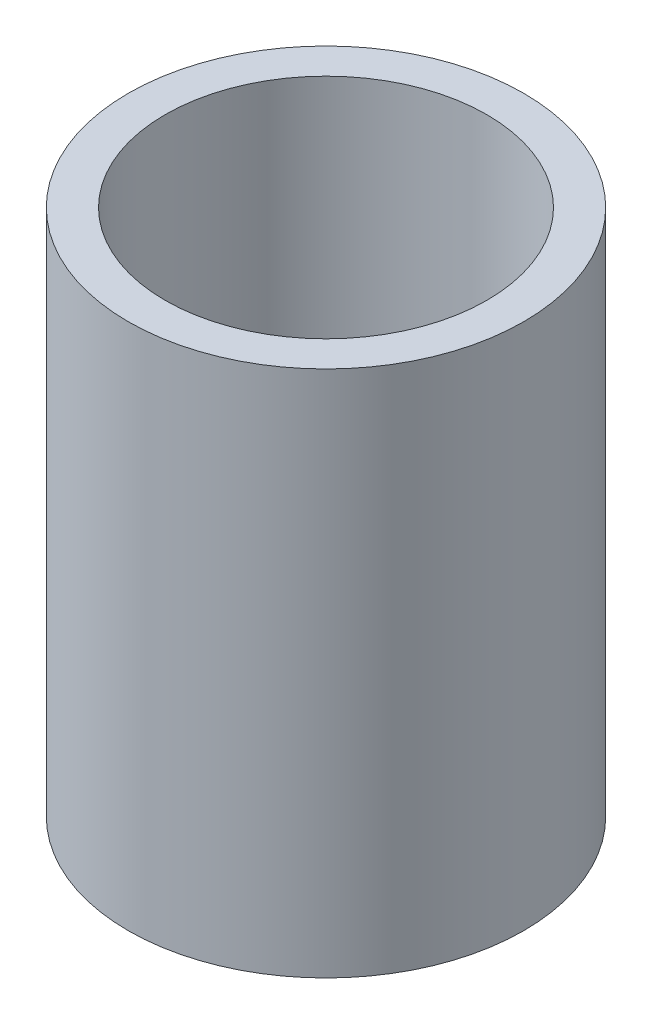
ISO-10303-21;
HEADER;
FILE_DESCRIPTION(('STEP AP214'),'2;1');
FILE_NAME('part.step','',(''),(''),'','','');
FILE_SCHEMA(('AUTOMOTIVE_DESIGN { 1 0 10303 214 1 1 1 1 }'));
ENDSEC;
DATA;
#1=APPLICATION_CONTEXT('core data for automotive mechanical design processes');
#2=APPLICATION_PROTOCOL_DEFINITION('international standard','automotive_design',2000,#1);
#3=PRODUCT_CONTEXT('',#1,'mechanical');
#4=PRODUCT('Part','Part','',(#3));
#5=PRODUCT_RELATED_PRODUCT_CATEGORY('part','',(#4));
#6=PRODUCT_DEFINITION_FORMATION('','',#4);
#7=PRODUCT_DEFINITION_CONTEXT('part definition',#1,'design');
#8=PRODUCT_DEFINITION('design','',#6,#7);
#9=PRODUCT_DEFINITION_SHAPE('','',#8);
#10=(LENGTH_UNIT() NAMED_UNIT(*) SI_UNIT(.MILLI.,.METRE.));
#11=(NAMED_UNIT(*) PLANE_ANGLE_UNIT() SI_UNIT($,.RADIAN.));
#12=(NAMED_UNIT(*) SI_UNIT($,.STERADIAN.) SOLID_ANGLE_UNIT());
#13=UNCERTAINTY_MEASURE_WITH_UNIT(LENGTH_MEASURE(1.E-05),#10,'distance_accuracy_value','');
#14=(GEOMETRIC_REPRESENTATION_CONTEXT(3) GLOBAL_UNCERTAINTY_ASSIGNED_CONTEXT((#13)) GLOBAL_UNIT_ASSIGNED_CONTEXT((#10,
#11,#12)) REPRESENTATION_CONTEXT('',''));
#15=CARTESIAN_POINT('',(0.,0.,0.));
#16=DIRECTION('',(0.,0.,1.));
#17=DIRECTION('',(1.,0.,0.));
#18=AXIS2_PLACEMENT_3D('',#15,#16,#17);
#19=CARTESIAN_POINT('',(0.,-26.1703841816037,0.));
#20=DIRECTION('',(0.,1.,0.));
#21=DIRECTION('',(0.,0.,1.));
#22=AXIS2_PLACEMENT_3D('',#19,#20,#21);
#23=CYLINDRICAL_SURFACE('',#22,4.7625);
#24=CARTESIAN_POINT('',(0.,-12.7,0.));
#25=DIRECTION('',(0.,1.,0.));
#26=DIRECTION('',(-0.694204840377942,0.,-0.71977749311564));
#27=AXIS2_PLACEMENT_3D('',#24,#25,#26);
#28=CIRCLE('',#27,4.7625);
#29=CARTESIAN_POINT('',(0.,-12.7,4.7625));
#30=VERTEX_POINT('',#29);
#31=EDGE_CURVE('E39',#30,#30,#28,.T.);
#32=CARTESIAN_POINT('',(0.,0.,0.));
#33=DIRECTION('',(0.,1.,0.));
#34=DIRECTION('',(0.,0.,1.));
#35=AXIS2_PLACEMENT_3D('',#32,#33,#34);
#36=CIRCLE('',#35,4.7625);
#37=CARTESIAN_POINT('',(0.,0.,4.7625));
#38=VERTEX_POINT('',#37);
#39=EDGE_CURVE('E35',#38,#38,#36,.T.);
#40=CARTESIAN_POINT('',(0.,-12.7,4.7625));
#41=CARTESIAN_POINT('',(0.,-12.5677083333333,4.7625));
#42=CARTESIAN_POINT('',(0.,-12.4354166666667,4.7625));
#43=CARTESIAN_POINT('',(0.,-12.1708333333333,4.7625));
#44=CARTESIAN_POINT('',(0.,-12.0385416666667,4.7625));
#45=CARTESIAN_POINT('',(0.,-11.7739583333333,4.7625));
#46=CARTESIAN_POINT('',(0.,-11.6416666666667,4.7625));
#47=CARTESIAN_POINT('',(0.,-11.3770833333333,4.7625));
#48=CARTESIAN_POINT('',(0.,-11.2447916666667,4.7625));
#49=CARTESIAN_POINT('',(0.,-10.9802083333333,4.7625));
#50=CARTESIAN_POINT('',(0.,-10.8479166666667,4.7625));
#51=CARTESIAN_POINT('',(0.,-10.5833333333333,4.7625));
#52=CARTESIAN_POINT('',(0.,-10.4510416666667,4.7625));
#53=CARTESIAN_POINT('',(0.,-10.1864583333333,4.7625));
#54=CARTESIAN_POINT('',(0.,-10.0541666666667,4.7625));
#55=CARTESIAN_POINT('',(0.,-9.78958333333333,4.7625));
#56=CARTESIAN_POINT('',(0.,-9.65729166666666,4.7625));
#57=CARTESIAN_POINT('',(0.,-9.39270833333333,4.7625));
#58=CARTESIAN_POINT('',(0.,-9.26041666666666,4.7625));
#59=CARTESIAN_POINT('',(0.,-8.99583333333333,4.7625));
#60=CARTESIAN_POINT('',(0.,-8.86354166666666,4.7625));
#61=CARTESIAN_POINT('',(0.,-8.59895833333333,4.7625));
#62=CARTESIAN_POINT('',(0.,-8.46666666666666,4.7625));
#63=CARTESIAN_POINT('',(0.,-8.20208333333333,4.7625));
#64=CARTESIAN_POINT('',(0.,-8.06979166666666,4.7625));
#65=CARTESIAN_POINT('',(0.,-7.80520833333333,4.7625));
#66=CARTESIAN_POINT('',(0.,-7.67291666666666,4.7625));
#67=CARTESIAN_POINT('',(0.,-7.40833333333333,4.7625));
#68=CARTESIAN_POINT('',(0.,-7.27604166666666,4.7625));
#69=CARTESIAN_POINT('',(0.,-7.01145833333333,4.7625));
#70=CARTESIAN_POINT('',(0.,-6.87916666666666,4.7625));
#71=CARTESIAN_POINT('',(0.,-6.61458333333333,4.7625));
#72=CARTESIAN_POINT('',(0.,-6.48229166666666,4.7625));
#73=CARTESIAN_POINT('',(0.,-6.21770833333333,4.7625));
#74=CARTESIAN_POINT('',(0.,-6.08541666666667,4.7625));
#75=CARTESIAN_POINT('',(0.,-5.82083333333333,4.7625));
#76=CARTESIAN_POINT('',(0.,-5.68854166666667,4.7625));
#77=CARTESIAN_POINT('',(0.,-5.42395833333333,4.7625));
#78=CARTESIAN_POINT('',(0.,-5.29166666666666,4.7625));
#79=CARTESIAN_POINT('',(0.,-5.02708333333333,4.7625));
#80=CARTESIAN_POINT('',(0.,-4.89479166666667,4.7625));
#81=CARTESIAN_POINT('',(0.,-4.63020833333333,4.7625));
#82=CARTESIAN_POINT('',(0.,-4.49791666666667,4.7625));
#83=CARTESIAN_POINT('',(0.,-4.23333333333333,4.7625));
#84=CARTESIAN_POINT('',(0.,-4.10104166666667,4.7625));
#85=CARTESIAN_POINT('',(0.,-3.83645833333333,4.7625));
#86=CARTESIAN_POINT('',(0.,-3.70416666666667,4.7625));
#87=CARTESIAN_POINT('',(0.,-3.43958333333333,4.7625));
#88=CARTESIAN_POINT('',(0.,-3.30729166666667,4.7625));
#89=CARTESIAN_POINT('',(0.,-3.04270833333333,4.7625));
#90=CARTESIAN_POINT('',(0.,-2.91041666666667,4.7625));
#91=CARTESIAN_POINT('',(0.,-2.64583333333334,4.7625));
#92=CARTESIAN_POINT('',(0.,-2.51354166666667,4.7625));
#93=CARTESIAN_POINT('',(0.,-2.24895833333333,4.7625));
#94=CARTESIAN_POINT('',(0.,-2.11666666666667,4.7625));
#95=CARTESIAN_POINT('',(0.,-1.85208333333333,4.7625));
#96=CARTESIAN_POINT('',(0.,-1.71979166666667,4.7625));
#97=CARTESIAN_POINT('',(0.,-1.45520833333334,4.7625));
#98=CARTESIAN_POINT('',(0.,-1.32291666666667,4.7625));
#99=CARTESIAN_POINT('',(0.,-1.05833333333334,4.7625));
#100=CARTESIAN_POINT('',(0.,-0.92604166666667,4.7625));
#101=CARTESIAN_POINT('',(0.,-0.661458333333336,4.7625));
#102=CARTESIAN_POINT('',(0.,-0.529166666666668,4.7625));
#103=CARTESIAN_POINT('',(0.,-0.264583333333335,4.7625));
#104=CARTESIAN_POINT('',(0.,-0.13229166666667,4.7625));
#105=CARTESIAN_POINT('',(0.,0.,4.7625));
#106=B_SPLINE_CURVE_WITH_KNOTS('',3,(#40,#41,#42,#43,#44,#45,#46,#47,#48,#49,#50,#51,#52,#53,
#54,#55,#56,#57,#58,#59,#60,#61,#62,#63,#64,#65,#66,#67,#68,#69,#70,#71,#72,#73,#74,#75,#76,#77,
#78,#79,#80,#81,#82,#83,#84,#85,#86,#87,#88,#89,#90,#91,#92,#93,#94,#95,#96,#97,#98,#99,#100,
#101,#102,#103,#104,#105),.UNSPECIFIED.,.F.,.F.,(4,2,2,2,2,2,2,2,2,2,2,2,2,2,2,2,2,2,2,2,2,2,2,
2,2,2,2,2,2,2,2,2,4),(0.,0.396875,0.793749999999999,1.190625,1.5875,1.984375,2.38125,2.778125,
3.175,3.57187499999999,3.96874999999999,4.365625,4.76249999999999,5.15937499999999,
5.55624999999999,5.95312499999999,6.34999999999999,6.74687499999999,7.14374999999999,
7.54062499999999,7.93749999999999,8.33437499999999,8.73124999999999,9.12812499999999,
9.52499999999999,9.92187499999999,10.31875,10.715625,11.1125,11.509375,11.90625,12.303125,12.7),.UNSPECIFIED.);
#107=EDGE_CURVE('BSEAM32',#30,#38,#106,.T.);
#108=ORIENTED_EDGE('',*,*,#31,.T.);
#109=ORIENTED_EDGE('',*,*,#39,.F.);
#110=ORIENTED_EDGE('',*,*,#107,.T.);
#111=ORIENTED_EDGE('',*,*,#107,.F.);
#112=EDGE_LOOP('',(#108,#110,#109,#111));
#113=FACE_BOUND('',#112,.T.);
#114=ADVANCED_FACE('F32',(#113),#23,.T.);
#115=CARTESIAN_POINT('',(0.,0.,0.));
#116=DIRECTION('',(0.,1.,0.));
#117=DIRECTION('',(0.,0.,1.));
#118=AXIS2_PLACEMENT_3D('',#115,#116,#117);
#119=PLANE('',#118);
#120=CARTESIAN_POINT('',(0.,0.,0.));
#121=DIRECTION('',(0.,1.,0.));
#122=DIRECTION('',(0.,0.,1.));
#123=AXIS2_PLACEMENT_3D('',#120,#121,#122);
#124=CIRCLE('',#123,3.8735);
#125=CARTESIAN_POINT('',(0.,0.,3.8735));
#126=VERTEX_POINT('',#125);
#127=EDGE_CURVE('E45',#126,#126,#124,.T.);
#128=ORIENTED_EDGE('',*,*,#127,.F.);
#129=EDGE_LOOP('',(#128));
#130=FACE_BOUND('',#129,.T.);
#131=ORIENTED_EDGE('',*,*,#39,.T.);
#132=EDGE_LOOP('',(#131));
#133=FACE_BOUND('',#132,.T.);
#134=ADVANCED_FACE('F52',(#130,#133),#119,.T.);
#135=CARTESIAN_POINT('',(0.,-26.1703841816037,0.));
#136=DIRECTION('',(0.,1.,0.));
#137=DIRECTION('',(0.,0.,1.));
#138=AXIS2_PLACEMENT_3D('',#135,#136,#137);
#139=CYLINDRICAL_SURFACE('',#138,3.8735);
#140=CARTESIAN_POINT('',(0.,-12.7,0.));
#141=DIRECTION('',(0.,-1.,0.));
#142=DIRECTION('',(0.694204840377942,0.,0.71977749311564));
#143=AXIS2_PLACEMENT_3D('',#140,#141,#142);
#144=CIRCLE('',#143,3.8735);
#145=CARTESIAN_POINT('',(0.,-12.7,3.8735));
#146=VERTEX_POINT('',#145);
#147=EDGE_CURVE('E10',#146,#146,#144,.T.);
#148=CARTESIAN_POINT('',(0.,-12.7,3.8735));
#149=CARTESIAN_POINT('',(0.,-12.5677083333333,3.8735));
#150=CARTESIAN_POINT('',(0.,-12.4354166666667,3.8735));
#151=CARTESIAN_POINT('',(0.,-12.1708333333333,3.8735));
#152=CARTESIAN_POINT('',(0.,-12.0385416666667,3.8735));
#153=CARTESIAN_POINT('',(0.,-11.7739583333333,3.8735));
#154=CARTESIAN_POINT('',(0.,-11.6416666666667,3.8735));
#155=CARTESIAN_POINT('',(0.,-11.3770833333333,3.8735));
#156=CARTESIAN_POINT('',(0.,-11.2447916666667,3.8735));
#157=CARTESIAN_POINT('',(0.,-10.9802083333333,3.8735));
#158=CARTESIAN_POINT('',(0.,-10.8479166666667,3.8735));
#159=CARTESIAN_POINT('',(0.,-10.5833333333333,3.8735));
#160=CARTESIAN_POINT('',(0.,-10.4510416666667,3.8735));
#161=CARTESIAN_POINT('',(0.,-10.1864583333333,3.8735));
#162=CARTESIAN_POINT('',(0.,-10.0541666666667,3.8735));
#163=CARTESIAN_POINT('',(0.,-9.78958333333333,3.8735));
#164=CARTESIAN_POINT('',(0.,-9.65729166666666,3.8735));
#165=CARTESIAN_POINT('',(0.,-9.39270833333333,3.8735));
#166=CARTESIAN_POINT('',(0.,-9.26041666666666,3.8735));
#167=CARTESIAN_POINT('',(0.,-8.99583333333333,3.8735));
#168=CARTESIAN_POINT('',(0.,-8.86354166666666,3.8735));
#169=CARTESIAN_POINT('',(0.,-8.59895833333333,3.8735));
#170=CARTESIAN_POINT('',(0.,-8.46666666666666,3.8735));
#171=CARTESIAN_POINT('',(0.,-8.20208333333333,3.8735));
#172=CARTESIAN_POINT('',(0.,-8.06979166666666,3.8735));
#173=CARTESIAN_POINT('',(0.,-7.80520833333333,3.8735));
#174=CARTESIAN_POINT('',(0.,-7.67291666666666,3.8735));
#175=CARTESIAN_POINT('',(0.,-7.40833333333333,3.8735));
#176=CARTESIAN_POINT('',(0.,-7.27604166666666,3.8735));
#177=CARTESIAN_POINT('',(0.,-7.01145833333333,3.8735));
#178=CARTESIAN_POINT('',(0.,-6.87916666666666,3.8735));
#179=CARTESIAN_POINT('',(0.,-6.61458333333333,3.8735));
#180=CARTESIAN_POINT('',(0.,-6.48229166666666,3.8735));
#181=CARTESIAN_POINT('',(0.,-6.21770833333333,3.8735));
#182=CARTESIAN_POINT('',(0.,-6.08541666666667,3.8735));
#183=CARTESIAN_POINT('',(0.,-5.82083333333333,3.8735));
#184=CARTESIAN_POINT('',(0.,-5.68854166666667,3.8735));
#185=CARTESIAN_POINT('',(0.,-5.42395833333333,3.8735));
#186=CARTESIAN_POINT('',(0.,-5.29166666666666,3.8735));
#187=CARTESIAN_POINT('',(0.,-5.02708333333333,3.8735));
#188=CARTESIAN_POINT('',(0.,-4.89479166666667,3.8735));
#189=CARTESIAN_POINT('',(0.,-4.63020833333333,3.8735));
#190=CARTESIAN_POINT('',(0.,-4.49791666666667,3.8735));
#191=CARTESIAN_POINT('',(0.,-4.23333333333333,3.8735));
#192=CARTESIAN_POINT('',(0.,-4.10104166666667,3.8735));
#193=CARTESIAN_POINT('',(0.,-3.83645833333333,3.8735));
#194=CARTESIAN_POINT('',(0.,-3.70416666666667,3.8735));
#195=CARTESIAN_POINT('',(0.,-3.43958333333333,3.8735));
#196=CARTESIAN_POINT('',(0.,-3.30729166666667,3.8735));
#197=CARTESIAN_POINT('',(0.,-3.04270833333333,3.8735));
#198=CARTESIAN_POINT('',(0.,-2.91041666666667,3.8735));
#199=CARTESIAN_POINT('',(0.,-2.64583333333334,3.8735));
#200=CARTESIAN_POINT('',(0.,-2.51354166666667,3.8735));
#201=CARTESIAN_POINT('',(0.,-2.24895833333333,3.8735));
#202=CARTESIAN_POINT('',(0.,-2.11666666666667,3.8735));
#203=CARTESIAN_POINT('',(0.,-1.85208333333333,3.8735));
#204=CARTESIAN_POINT('',(0.,-1.71979166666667,3.8735));
#205=CARTESIAN_POINT('',(0.,-1.45520833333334,3.8735));
#206=CARTESIAN_POINT('',(0.,-1.32291666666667,3.8735));
#207=CARTESIAN_POINT('',(0.,-1.05833333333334,3.8735));
#208=CARTESIAN_POINT('',(0.,-0.92604166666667,3.8735));
#209=CARTESIAN_POINT('',(0.,-0.661458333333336,3.8735));
#210=CARTESIAN_POINT('',(0.,-0.529166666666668,3.8735));
#211=CARTESIAN_POINT('',(0.,-0.264583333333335,3.8735));
#212=CARTESIAN_POINT('',(0.,-0.13229166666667,3.8735));
#213=CARTESIAN_POINT('',(0.,0.,3.8735));
#214=B_SPLINE_CURVE_WITH_KNOTS('',3,(#148,#149,#150,#151,#152,#153,#154,#155,#156,#157,#158,
#159,#160,#161,#162,#163,#164,#165,#166,#167,#168,#169,#170,#171,#172,#173,#174,#175,#176,#177,
#178,#179,#180,#181,#182,#183,#184,#185,#186,#187,#188,#189,#190,#191,#192,#193,#194,#195,#196,
#197,#198,#199,#200,#201,#202,#203,#204,#205,#206,#207,#208,#209,#210,#211,#212,#213),
.UNSPECIFIED.,.F.,.F.,(4,2,2,2,2,2,2,2,2,2,2,2,2,2,2,2,2,2,2,2,2,2,2,2,2,2,2,2,2,2,2,2,4),(0.,
0.396875,0.793749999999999,1.190625,1.5875,1.984375,2.38125,2.778125,3.175,3.57187499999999,
3.96874999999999,4.365625,4.76249999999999,5.15937499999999,5.55624999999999,5.95312499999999,
6.34999999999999,6.74687499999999,7.14374999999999,7.54062499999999,7.93749999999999,
8.33437499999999,8.73124999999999,9.12812499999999,9.52499999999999,9.92187499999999,10.31875,
10.715625,11.1125,11.509375,11.90625,12.303125,12.7),.UNSPECIFIED.);
#215=EDGE_CURVE('BSEAM59',#146,#126,#214,.T.);
#216=ORIENTED_EDGE('',*,*,#147,.T.);
#217=ORIENTED_EDGE('',*,*,#127,.T.);
#218=ORIENTED_EDGE('',*,*,#215,.T.);
#219=ORIENTED_EDGE('',*,*,#215,.F.);
#220=EDGE_LOOP('',(#216,#218,#217,#219));
#221=FACE_BOUND('',#220,.T.);
#222=ADVANCED_FACE('F59',(#221),#139,.F.);
#223=CARTESIAN_POINT('',(1.65307527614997,-12.7,1.71397015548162));
#224=DIRECTION('',(0.,1.,0.));
#225=DIRECTION('',(-0.694204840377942,0.,-0.71977749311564));
#226=AXIS2_PLACEMENT_3D('',#223,#224,#225);
#227=PLANE('',#226);
#228=ORIENTED_EDGE('',*,*,#31,.F.);
#229=EDGE_LOOP('',(#228));
#230=FACE_BOUND('',#229,.T.);
#231=ORIENTED_EDGE('',*,*,#147,.F.);
#232=EDGE_LOOP('',(#231));
#233=FACE_BOUND('',#232,.T.);
#234=ADVANCED_FACE('F63',(#230,#233),#227,.F.);
#235=CLOSED_SHELL('',(#114,#134,#222,#234));
#236=MANIFOLD_SOLID_BREP('B2',#235);
#237=ADVANCED_BREP_SHAPE_REPRESENTATION('',(#18,#236),#14);
#238=SHAPE_DEFINITION_REPRESENTATION(#9,#237);
ENDSEC;
END-ISO-10303-21;
